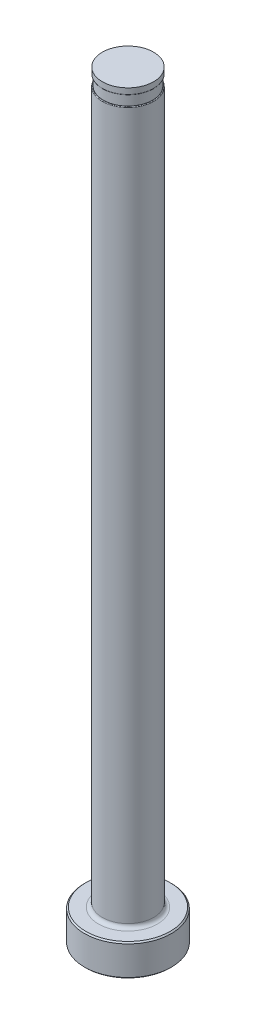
ISO-10303-21;
HEADER;
FILE_DESCRIPTION(('STEP AP214'),'2;1');
FILE_NAME('part.step','',(''),(''),'','','');
FILE_SCHEMA(('AUTOMOTIVE_DESIGN { 1 0 10303 214 1 1 1 1 }'));
ENDSEC;
DATA;
#1=APPLICATION_CONTEXT('core data for automotive mechanical design processes');
#2=APPLICATION_PROTOCOL_DEFINITION('international standard','automotive_design',2000,#1);
#3=PRODUCT_CONTEXT('',#1,'mechanical');
#4=PRODUCT('Part','Part','',(#3));
#5=PRODUCT_RELATED_PRODUCT_CATEGORY('part','',(#4));
#6=PRODUCT_DEFINITION_FORMATION('','',#4);
#7=PRODUCT_DEFINITION_CONTEXT('part definition',#1,'design');
#8=PRODUCT_DEFINITION('design','',#6,#7);
#9=PRODUCT_DEFINITION_SHAPE('','',#8);
#10=(LENGTH_UNIT() NAMED_UNIT(*) SI_UNIT(.MILLI.,.METRE.));
#11=(NAMED_UNIT(*) PLANE_ANGLE_UNIT() SI_UNIT($,.RADIAN.));
#12=(NAMED_UNIT(*) SI_UNIT($,.STERADIAN.) SOLID_ANGLE_UNIT());
#13=UNCERTAINTY_MEASURE_WITH_UNIT(LENGTH_MEASURE(1.E-05),#10,'distance_accuracy_value','');
#14=(GEOMETRIC_REPRESENTATION_CONTEXT(3) GLOBAL_UNCERTAINTY_ASSIGNED_CONTEXT((#13)) GLOBAL_UNIT_ASSIGNED_CONTEXT((#10,
#11,#12)) REPRESENTATION_CONTEXT('',''));
#15=CARTESIAN_POINT('',(0.,0.,0.));
#16=DIRECTION('',(0.,0.,1.));
#17=DIRECTION('',(1.,0.,0.));
#18=AXIS2_PLACEMENT_3D('',#15,#16,#17);
#19=CARTESIAN_POINT('',(-5.15873999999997,151.13,0.));
#20=DIRECTION('',(0.,1.,0.));
#21=DIRECTION('',(0.,0.,1.));
#22=AXIS2_PLACEMENT_3D('',#19,#20,#21);
#23=PLANE('',#22);
#24=CARTESIAN_POINT('',(0.,151.13,0.));
#25=DIRECTION('',(0.,1.,0.));
#26=DIRECTION('',(0.,0.,1.));
#27=AXIS2_PLACEMENT_3D('',#24,#25,#26);
#28=CIRCLE('',#27,5.01903999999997);
#29=CARTESIAN_POINT('',(0.,151.13,5.01903999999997));
#30=VERTEX_POINT('',#29);
#31=EDGE_CURVE('E11',#30,#30,#28,.F.);
#32=ORIENTED_EDGE('',*,*,#31,.T.);
#33=EDGE_LOOP('',(#32));
#34=FACE_BOUND('',#33,.T.);
#35=CARTESIAN_POINT('',(0.,151.13,0.));
#36=DIRECTION('',(0.,1.,0.));
#37=DIRECTION('',(0.,0.,1.));
#38=AXIS2_PLACEMENT_3D('',#35,#36,#37);
#39=CIRCLE('',#38,4.95553999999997);
#40=CARTESIAN_POINT('',(0.,151.13,4.95553999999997));
#41=VERTEX_POINT('',#40);
#42=EDGE_CURVE('E78',#41,#41,#39,.T.);
#43=ORIENTED_EDGE('',*,*,#42,.T.);
#44=EDGE_LOOP('',(#43));
#45=FACE_BOUND('',#44,.T.);
#46=ADVANCED_FACE('F36',(#34,#45),#23,.F.);
#47=CARTESIAN_POINT('',(0.,259.958771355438,0.));
#48=DIRECTION('',(0.,1.,0.));
#49=DIRECTION('',(0.,0.,1.));
#50=AXIS2_PLACEMENT_3D('',#47,#48,#49);
#51=CYLINDRICAL_SURFACE('',#50,5.15873999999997);
#52=DIRECTION('',(0.,1.,0.));
#53=VECTOR('',#52,1.);
#54=CARTESIAN_POINT('',(-4.95553999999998,259.958771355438,-1.43360444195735));
#55=LINE('',#54,#53);
#56=CARTESIAN_POINT('',(-4.95553999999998,148.971,-1.43360444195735));
#57=VERTEX_POINT('',#56);
#58=CARTESIAN_POINT('',(-4.95553999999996,86.614,-1.43360444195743));
#59=VERTEX_POINT('',#58);
#60=EDGE_CURVE('E73',#57,#59,#55,.F.);
#61=ORIENTED_EDGE('',*,*,#60,.F.);
#62=CARTESIAN_POINT('',(0.,148.971,0.));
#63=DIRECTION('',(0.,-1.,0.));
#64=DIRECTION('',(0.,0.,-1.));
#65=AXIS2_PLACEMENT_3D('',#62,#63,#64);
#66=CIRCLE('',#65,5.15873999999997);
#67=CARTESIAN_POINT('',(-4.95553999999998,148.971,1.43360444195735));
#68=VERTEX_POINT('',#67);
#69=EDGE_CURVE('E51',#57,#68,#66,.T.);
#70=ORIENTED_EDGE('',*,*,#69,.T.);
#71=DIRECTION('',(0.,1.,0.));
#72=VECTOR('',#71,1.);
#73=CARTESIAN_POINT('',(-4.95553999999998,259.958771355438,1.43360444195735));
#74=LINE('',#73,#72);
#75=CARTESIAN_POINT('',(-4.95553999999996,86.614,1.43360444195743));
#76=VERTEX_POINT('',#75);
#77=EDGE_CURVE('E84',#76,#68,#74,.T.);
#78=ORIENTED_EDGE('',*,*,#77,.F.);
#79=CARTESIAN_POINT('',(-4.95553999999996,86.614,-1.43360444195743));
#80=CARTESIAN_POINT('',(-4.95553725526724,86.5856189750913,-1.43360739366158));
#81=CARTESIAN_POINT('',(-4.95592104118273,86.5572557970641,-1.43228786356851));
#82=CARTESIAN_POINT('',(-4.95743326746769,86.5008072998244,-1.42704770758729));
#83=CARTESIAN_POINT('',(-4.9585612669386,86.4727218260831,-1.42312862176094));
#84=CARTESIAN_POINT('',(-4.9629961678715,86.3896356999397,-1.40761778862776));
#85=CARTESIAN_POINT('',(-4.96735491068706,86.3353485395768,-1.39227082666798));
#86=CARTESIAN_POINT('',(-4.97832723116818,86.2306470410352,-1.35250608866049));
#87=CARTESIAN_POINT('',(-4.98493672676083,86.18022589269,-1.32810472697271));
#88=CARTESIAN_POINT('',(-4.99967949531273,86.0841857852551,-1.27147840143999));
#89=CARTESIAN_POINT('',(-5.00781478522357,86.038573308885,-1.23924306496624));
#90=CARTESIAN_POINT('',(-5.02495905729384,85.9522108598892,-1.16779718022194));
#91=CARTESIAN_POINT('',(-5.03397951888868,85.9115461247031,-1.12848730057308));
#92=CARTESIAN_POINT('',(-5.05205730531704,85.8361357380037,-1.04458765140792));
#93=CARTESIAN_POINT('',(-5.0611146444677,85.8013926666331,-0.999995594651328));
#94=CARTESIAN_POINT('',(-5.0828087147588,85.722744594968,-0.884599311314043));
#95=CARTESIAN_POINT('',(-5.09511168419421,85.6822810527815,-0.811374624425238));
#96=CARTESIAN_POINT('',(-5.11705340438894,85.6135884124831,-0.659025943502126));
#97=CARTESIAN_POINT('',(-5.12668809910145,85.5853779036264,-0.579893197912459));
#98=CARTESIAN_POINT('',(-5.14250736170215,85.5402853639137,-0.417111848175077));
#99=CARTESIAN_POINT('',(-5.14864831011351,85.5235460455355,-0.333419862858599));
#100=CARTESIAN_POINT('',(-5.15681634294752,85.5014682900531,-0.164367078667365));
#101=CARTESIAN_POINT('',(-5.15884262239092,85.4961320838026,-0.0790059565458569));
#102=CARTESIAN_POINT('',(-5.15861184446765,85.4967349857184,0.105901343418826));
#103=CARTESIAN_POINT('',(-5.15558674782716,85.5046959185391,0.205446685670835));
#104=CARTESIAN_POINT('',(-5.14401053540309,85.5362458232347,0.401751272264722));
#105=CARTESIAN_POINT('',(-5.13546035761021,85.5598321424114,0.498510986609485));
#106=CARTESIAN_POINT('',(-5.11591338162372,85.6173193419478,0.667702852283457));
#107=CARTESIAN_POINT('',(-5.10571393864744,85.6483284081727,0.741210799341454));
#108=CARTESIAN_POINT('',(-5.08327564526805,85.7216570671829,0.882022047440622));
#109=CARTESIAN_POINT('',(-5.07103965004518,85.763960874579,0.949333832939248));
#110=CARTESIAN_POINT('',(-5.04847334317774,85.8504217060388,1.06213618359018));
#111=CARTESIAN_POINT('',(-5.03826194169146,85.892449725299,1.10927984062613));
#112=CARTESIAN_POINT('',(-5.01836605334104,85.9837827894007,1.19606762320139));
#113=CARTESIAN_POINT('',(-5.00868105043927,86.0330805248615,1.23571919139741));
#114=CARTESIAN_POINT('',(-4.99227488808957,86.1303011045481,1.30028176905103));
#115=CARTESIAN_POINT('',(-4.98532701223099,86.1773061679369,1.3265147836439));
#116=CARTESIAN_POINT('',(-4.97328889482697,86.2751640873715,1.37095861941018));
#117=CARTESIAN_POINT('',(-4.96819584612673,86.3260109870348,1.38918157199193));
#118=CARTESIAN_POINT('',(-4.96145831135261,86.4164594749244,1.41302693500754));
#119=CARTESIAN_POINT('',(-4.95925840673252,86.4554867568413,1.42070567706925));
#120=CARTESIAN_POINT('',(-4.95629015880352,86.5343307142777,1.43101136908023));
#121=CARTESIAN_POINT('',(-4.95552461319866,86.5741487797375,1.4336284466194));
#122=CARTESIAN_POINT('',(-4.95553999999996,86.614,1.43360444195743));
#123=B_SPLINE_CURVE_WITH_KNOTS('',3,(#79,#80,#81,#82,#83,#84,#85,#86,#87,#88,#89,#90,#91,#92,
#93,#94,#95,#96,#97,#98,#99,#100,#101,#102,#103,#104,#105,#106,#107,#108,#109,#110,#111,#112,
#113,#114,#115,#116,#117,#118,#119,#120,#121,#122),.UNSPECIFIED.,.F.,.F.,(4,2,2,2,2,2,2,2,2,2,2,
2,2,2,2,2,2,2,2,2,2,4),(0.,0.0850755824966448,0.170100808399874,0.338803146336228,
0.507201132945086,0.675823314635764,0.84702982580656,1.01831074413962,1.27062211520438,
1.52331494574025,1.77909706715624,2.03492922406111,2.33328986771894,2.63159987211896,
2.87199032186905,3.11204654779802,3.30325159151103,3.49426568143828,3.6564175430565,
3.81832296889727,3.93749321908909,4.05689566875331),.UNSPECIFIED.);
#124=EDGE_CURVE('E81',#59,#76,#123,.T.);
#125=ORIENTED_EDGE('',*,*,#124,.F.);
#126=EDGE_LOOP('',(#61,#70,#78,#125));
#127=FACE_BOUND('',#126,.T.);
#128=CARTESIAN_POINT('',(0.,7.11200000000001,0.));
#129=DIRECTION('',(0.,1.,0.));
#130=DIRECTION('',(0.,0.,1.));
#131=AXIS2_PLACEMENT_3D('',#128,#129,#130);
#132=CIRCLE('',#131,5.15873999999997);
#133=CARTESIAN_POINT('',(0.,7.11200000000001,5.15873999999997));
#134=VERTEX_POINT('',#133);
#135=EDGE_CURVE('E116',#134,#134,#132,.T.);
#136=ORIENTED_EDGE('',*,*,#135,.T.);
#137=EDGE_LOOP('',(#136));
#138=FACE_BOUND('',#137,.T.);
#139=ADVANCED_FACE('F82',(#127,#138),#51,.T.);
#140=CARTESIAN_POINT('',(0.,0.,0.));
#141=DIRECTION('',(0.,-1.,0.));
#142=DIRECTION('',(0.,0.,-1.));
#143=AXIS2_PLACEMENT_3D('',#140,#141,#142);
#144=PLANE('',#143);
#145=CARTESIAN_POINT('',(0.,0.,0.));
#146=DIRECTION('',(0.,-1.,0.));
#147=DIRECTION('',(0.,0.,-1.));
#148=AXIS2_PLACEMENT_3D('',#145,#146,#147);
#149=CIRCLE('',#148,8.47089999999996);
#150=CARTESIAN_POINT('',(0.,0.,-8.47089999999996));
#151=VERTEX_POINT('',#150);
#152=EDGE_CURVE('E113',#151,#151,#149,.T.);
#153=ORIENTED_EDGE('',*,*,#152,.T.);
#154=EDGE_LOOP('',(#153));
#155=FACE_BOUND('',#154,.T.);
#156=ADVANCED_FACE('F192',(#155),#144,.T.);
#157=CARTESIAN_POINT('',(0.,259.958771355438,0.));
#158=DIRECTION('',(0.,1.,0.));
#159=DIRECTION('',(0.,0.,1.));
#160=AXIS2_PLACEMENT_3D('',#157,#158,#159);
#161=CYLINDRICAL_SURFACE('',#160,8.72489999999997);
#162=CARTESIAN_POINT('',(0.,6.09600000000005,0.));
#163=DIRECTION('',(0.,1.,0.));
#164=DIRECTION('',(0.,0.,1.));
#165=AXIS2_PLACEMENT_3D('',#162,#163,#164);
#166=CIRCLE('',#165,8.72489999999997);
#167=CARTESIAN_POINT('',(0.,6.09600000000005,8.72489999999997));
#168=VERTEX_POINT('',#167);
#169=EDGE_CURVE('E110',#168,#168,#166,.F.);
#170=ORIENTED_EDGE('',*,*,#169,.T.);
#171=EDGE_LOOP('',(#170));
#172=FACE_BOUND('',#171,.T.);
#173=CARTESIAN_POINT('',(0.,0.254000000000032,0.));
#174=DIRECTION('',(0.,-1.,0.));
#175=DIRECTION('',(0.,0.,-1.));
#176=AXIS2_PLACEMENT_3D('',#173,#174,#175);
#177=CIRCLE('',#176,8.72489999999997);
#178=CARTESIAN_POINT('',(0.,0.254000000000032,-8.72489999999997));
#179=VERTEX_POINT('',#178);
#180=EDGE_CURVE('E107',#179,#179,#177,.F.);
#181=ORIENTED_EDGE('',*,*,#180,.T.);
#182=EDGE_LOOP('',(#181));
#183=FACE_BOUND('',#182,.T.);
#184=ADVANCED_FACE('F195',(#172,#183),#161,.T.);
#185=CARTESIAN_POINT('',(-8.72489999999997,6.35,0.));
#186=DIRECTION('',(0.,1.,0.));
#187=DIRECTION('',(0.,0.,1.));
#188=AXIS2_PLACEMENT_3D('',#185,#186,#187);
#189=PLANE('',#188);
#190=CARTESIAN_POINT('',(0.,6.35,0.));
#191=DIRECTION('',(0.,1.,0.));
#192=DIRECTION('',(0.,0.,1.));
#193=AXIS2_PLACEMENT_3D('',#190,#191,#192);
#194=CIRCLE('',#193,5.92073999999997);
#195=CARTESIAN_POINT('',(0.,6.35,5.92073999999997));
#196=VERTEX_POINT('',#195);
#197=EDGE_CURVE('E87',#196,#196,#194,.F.);
#198=ORIENTED_EDGE('',*,*,#197,.T.);
#199=EDGE_LOOP('',(#198));
#200=FACE_BOUND('',#199,.T.);
#201=CARTESIAN_POINT('',(0.,6.35,0.));
#202=DIRECTION('',(0.,1.,0.));
#203=DIRECTION('',(0.,0.,1.));
#204=AXIS2_PLACEMENT_3D('',#201,#202,#203);
#205=CIRCLE('',#204,8.47090000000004);
#206=CARTESIAN_POINT('',(0.,6.35,8.47090000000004));
#207=VERTEX_POINT('',#206);
#208=EDGE_CURVE('E104',#207,#207,#205,.T.);
#209=ORIENTED_EDGE('',*,*,#208,.T.);
#210=EDGE_LOOP('',(#209));
#211=FACE_BOUND('',#210,.T.);
#212=ADVANCED_FACE('F190',(#200,#211),#189,.T.);
#213=CARTESIAN_POINT('',(0.,6.35000000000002,0.));
#214=DIRECTION('',(0.,-1.,0.));
#215=DIRECTION('',(0.,0.,-1.));
#216=AXIS2_PLACEMENT_3D('',#213,#214,#215);
#217=CONICAL_SURFACE('',#216,8.47090000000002,0.785398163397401);
#218=ORIENTED_EDGE('',*,*,#169,.F.);
#219=EDGE_LOOP('',(#218));
#220=FACE_BOUND('',#219,.T.);
#221=ORIENTED_EDGE('',*,*,#208,.F.);
#222=EDGE_LOOP('',(#221));
#223=FACE_BOUND('',#222,.T.);
#224=ADVANCED_FACE('F186',(#220,#223),#217,.T.);
#225=CARTESIAN_POINT('',(0.,0.254000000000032,0.));
#226=DIRECTION('',(0.,1.,0.));
#227=DIRECTION('',(0.,0.,1.));
#228=AXIS2_PLACEMENT_3D('',#225,#226,#227);
#229=CONICAL_SURFACE('',#228,8.72489999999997,0.785398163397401);
#230=ORIENTED_EDGE('',*,*,#152,.F.);
#231=EDGE_LOOP('',(#230));
#232=FACE_BOUND('',#231,.T.);
#233=ORIENTED_EDGE('',*,*,#180,.F.);
#234=EDGE_LOOP('',(#233));
#235=FACE_BOUND('',#234,.T.);
#236=ADVANCED_FACE('F182',(#232,#235),#229,.T.);
#237=CARTESIAN_POINT('',(0.,7.11200000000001,0.));
#238=DIRECTION('',(0.,1.,0.));
#239=DIRECTION('',(0.,0.,1.));
#240=AXIS2_PLACEMENT_3D('',#237,#238,#239);
#241=TOROIDAL_SURFACE('',#240,5.92073999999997,0.762);
#242=ORIENTED_EDGE('',*,*,#197,.F.);
#243=EDGE_LOOP('',(#242));
#244=FACE_BOUND('',#243,.T.);
#245=ORIENTED_EDGE('',*,*,#135,.F.);
#246=EDGE_LOOP('',(#245));
#247=FACE_BOUND('',#246,.T.);
#248=ADVANCED_FACE('F147',(#244,#247),#241,.F.);
#249=CARTESIAN_POINT('',(-5.15873999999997,149.098,0.));
#250=DIRECTION('',(0.,-1.,0.));
#251=DIRECTION('',(0.,0.,-1.));
#252=AXIS2_PLACEMENT_3D('',#249,#250,#251);
#253=PLANE('',#252);
#254=DIRECTION('',(0.,0.,1.));
#255=VECTOR('',#254,1.);
#256=CARTESIAN_POINT('',(-4.95553999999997,149.098,0.));
#257=LINE('',#256,#255);
#258=CARTESIAN_POINT('',(-4.95553999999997,149.098,0.));
#259=VERTEX_POINT('',#258);
#260=CARTESIAN_POINT('',(-4.95553999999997,149.098,0.872370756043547));
#261=VERTEX_POINT('',#260);
#262=EDGE_CURVE('E90',#259,#261,#257,.T.);
#263=ORIENTED_EDGE('',*,*,#262,.T.);
#264=CARTESIAN_POINT('',(0.,149.098,0.));
#265=DIRECTION('',(0.,-1.,0.));
#266=DIRECTION('',(0.,0.,-1.));
#267=AXIS2_PLACEMENT_3D('',#264,#265,#266);
#268=CIRCLE('',#267,5.03173999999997);
#269=CARTESIAN_POINT('',(-4.95553999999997,149.098,-0.872370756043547));
#270=VERTEX_POINT('',#269);
#271=EDGE_CURVE('E86',#261,#270,#268,.F.);
#272=ORIENTED_EDGE('',*,*,#271,.T.);
#273=EDGE_CURVE('E79',#270,#259,#257,.T.);
#274=ORIENTED_EDGE('',*,*,#273,.T.);
#275=CARTESIAN_POINT('',(0.,149.098,0.));
#276=DIRECTION('',(0.,1.,0.));
#277=DIRECTION('',(0.,0.,1.));
#278=AXIS2_PLACEMENT_3D('',#275,#276,#277);
#279=CIRCLE('',#278,4.95553999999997);
#280=EDGE_CURVE('E101',#259,#259,#279,.T.);
#281=ORIENTED_EDGE('',*,*,#280,.F.);
#282=EDGE_LOOP('',(#263,#272,#274,#281));
#283=FACE_BOUND('',#282,.T.);
#284=ADVANCED_FACE('F144',(#283),#253,.F.);
#285=CARTESIAN_POINT('',(0.,153.448281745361,0.));
#286=DIRECTION('',(0.,1.,0.));
#287=DIRECTION('',(0.,0.,1.));
#288=AXIS2_PLACEMENT_3D('',#285,#286,#287);
#289=CYLINDRICAL_SURFACE('',#288,4.95553999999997);
#290=ORIENTED_EDGE('',*,*,#42,.F.);
#291=EDGE_LOOP('',(#290));
#292=FACE_BOUND('',#291,.T.);
#293=ORIENTED_EDGE('',*,*,#280,.T.);
#294=EDGE_LOOP('',(#293));
#295=FACE_BOUND('',#294,.T.);
#296=ADVANCED_FACE('F141',(#292,#295),#289,.T.);
#297=CARTESIAN_POINT('',(-4.95553999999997,150.114,-8.72489999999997));
#298=DIRECTION('',(1.,0.,0.));
#299=DIRECTION('',(0.,1.,0.));
#300=AXIS2_PLACEMENT_3D('',#297,#298,#299);
#301=PLANE('',#300);
#302=ORIENTED_EDGE('',*,*,#273,.F.);
#303=CARTESIAN_POINT('',(-4.95553999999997,149.098,-0.872370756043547));
#304=CARTESIAN_POINT('',(-4.95553999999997,149.097997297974,-0.893106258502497));
#305=CARTESIAN_POINT('',(-4.95553999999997,149.097847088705,-0.913843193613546));
#306=CARTESIAN_POINT('',(-4.95553999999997,149.097170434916,-0.955336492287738));
#307=CARTESIAN_POINT('',(-4.95553999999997,149.096643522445,-0.976092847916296));
#308=CARTESIAN_POINT('',(-4.95553999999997,149.095099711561,-1.01847199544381));
#309=CARTESIAN_POINT('',(-4.95553999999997,149.09406293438,-1.04009410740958));
#310=CARTESIAN_POINT('',(-4.95553999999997,149.091368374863,-1.08327970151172));
#311=CARTESIAN_POINT('',(-4.95553999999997,149.089711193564,-1.10484322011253));
#312=CARTESIAN_POINT('',(-4.95553999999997,149.085606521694,-1.14789214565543));
#313=CARTESIAN_POINT('',(-4.95553999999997,149.083159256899,-1.16937757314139));
#314=CARTESIAN_POINT('',(-4.95553999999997,149.077206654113,-1.21226394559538));
#315=CARTESIAN_POINT('',(-4.95553999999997,149.073698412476,-1.23366449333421));
#316=CARTESIAN_POINT('',(-4.95553999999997,149.065283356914,-1.27578226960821));
#317=CARTESIAN_POINT('',(-4.95553999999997,149.06040504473,-1.29650469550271));
#318=CARTESIAN_POINT('',(-4.95553999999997,149.051386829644,-1.32704228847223));
#319=CARTESIAN_POINT('',(-4.95553999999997,149.048106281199,-1.33710914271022));
#320=CARTESIAN_POINT('',(-4.95553999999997,149.04076790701,-1.35695139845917));
#321=CARTESIAN_POINT('',(-4.95553999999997,149.036711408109,-1.36672726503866));
#322=CARTESIAN_POINT('',(-4.95553999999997,149.029963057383,-1.38055335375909));
#323=CARTESIAN_POINT('',(-4.95553999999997,149.027728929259,-1.38482589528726));
#324=CARTESIAN_POINT('',(-4.95553999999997,149.022950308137,-1.39320953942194));
#325=CARTESIAN_POINT('',(-4.95553999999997,149.020405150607,-1.39732027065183));
#326=CARTESIAN_POINT('',(-4.95553999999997,149.014903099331,-1.40530983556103));
#327=CARTESIAN_POINT('',(-4.95553999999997,149.011943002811,-1.4091864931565));
#328=CARTESIAN_POINT('',(-4.95553999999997,149.005504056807,-1.4164922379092));
#329=CARTESIAN_POINT('',(-4.95553999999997,149.002026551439,-1.41992244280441));
#330=CARTESIAN_POINT('',(-4.95553999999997,148.996255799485,-1.4245087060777));
#331=CARTESIAN_POINT('',(-4.95553999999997,148.994201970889,-1.42596287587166));
#332=CARTESIAN_POINT('',(-4.95553999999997,148.989918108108,-1.42856560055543));
#333=CARTESIAN_POINT('',(-4.95553999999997,148.98768896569,-1.42971558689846));
#334=CARTESIAN_POINT('',(-4.95553999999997,148.983116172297,-1.4315912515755));
#335=CARTESIAN_POINT('',(-4.95553999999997,148.980776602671,-1.43232653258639));
#336=CARTESIAN_POINT('',(-4.95553999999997,148.975963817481,-1.43334161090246));
#337=CARTESIAN_POINT('',(-4.95553999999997,148.973489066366,-1.43361396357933));
#338=CARTESIAN_POINT('',(-4.95553999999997,148.971,-1.4336044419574));
#339=B_SPLINE_CURVE_WITH_KNOTS('',3,(#303,#304,#305,#306,#307,#308,#309,#310,#311,#312,#313,
#314,#315,#316,#317,#318,#319,#320,#321,#322,#323,#324,#325,#326,#327,#328,#329,#330,#331,#332,
#333,#334,#335,#336,#337,#338),.UNSPECIFIED.,.F.,.F.,(4,2,2,2,2,2,2,2,2,2,2,2,2,2,2,2,2,4),(0.,
0.062208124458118,0.124493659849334,0.189427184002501,0.254297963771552,0.319150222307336,
0.384181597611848,0.447949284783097,0.479695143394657,0.511387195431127,0.525842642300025,
0.54032953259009,0.554935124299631,0.569503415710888,0.577034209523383,0.584528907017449,
0.591842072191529,0.599271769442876),.UNSPECIFIED.);
#340=EDGE_CURVE('E59',#270,#57,#339,.T.);
#341=ORIENTED_EDGE('',*,*,#340,.T.);
#342=ORIENTED_EDGE('',*,*,#60,.T.);
#343=DIRECTION('',(0.,0.,1.));
#344=VECTOR('',#343,1.);
#345=CARTESIAN_POINT('',(-4.95553999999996,86.614,-8.72489999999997));
#346=LINE('',#345,#344);
#347=EDGE_CURVE('E77',#59,#76,#346,.T.);
#348=ORIENTED_EDGE('',*,*,#347,.T.);
#349=ORIENTED_EDGE('',*,*,#77,.T.);
#350=CARTESIAN_POINT('',(-4.95553999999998,148.971,1.43360444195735));
#351=CARTESIAN_POINT('',(-4.95553999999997,148.973376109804,1.43361259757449));
#352=CARTESIAN_POINT('',(-4.95553999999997,148.975740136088,1.4333648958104));
#353=CARTESIAN_POINT('',(-4.95553999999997,148.980346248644,1.43243706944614));
#354=CARTESIAN_POINT('',(-4.95553999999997,148.982589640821,1.43176356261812));
#355=CARTESIAN_POINT('',(-4.95553999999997,148.987448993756,1.4298565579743));
#356=CARTESIAN_POINT('',(-4.95553999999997,148.990026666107,1.42852797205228));
#357=CARTESIAN_POINT('',(-4.95553999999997,148.994948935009,1.42547523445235));
#358=CARTESIAN_POINT('',(-4.95553999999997,148.997291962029,1.42374864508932));
#359=CARTESIAN_POINT('',(-4.95553999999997,149.003411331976,1.4186377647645));
#360=CARTESIAN_POINT('',(-4.95553999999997,149.006953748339,1.41497736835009));
#361=CARTESIAN_POINT('',(-4.95553999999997,149.013498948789,1.40721445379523));
#362=CARTESIAN_POINT('',(-4.95553999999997,149.016500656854,1.40311107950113));
#363=CARTESIAN_POINT('',(-4.95553999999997,149.023478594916,1.39255193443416));
#364=CARTESIAN_POINT('',(-4.95553999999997,149.027205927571,1.38593356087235));
#365=CARTESIAN_POINT('',(-4.95553999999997,149.034038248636,1.37237820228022));
#366=CARTESIAN_POINT('',(-4.95553999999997,149.037141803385,1.36544052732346));
#367=CARTESIAN_POINT('',(-4.95553999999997,149.045787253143,1.34428318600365));
#368=CARTESIAN_POINT('',(-4.95553999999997,149.050628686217,1.32978099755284));
#369=CARTESIAN_POINT('',(-4.95553999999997,149.063034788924,1.28723764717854));
#370=CARTESIAN_POINT('',(-4.95553999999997,149.069113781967,1.25878972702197));
#371=CARTESIAN_POINT('',(-4.95553999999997,149.079029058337,1.20147182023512));
#372=CARTESIAN_POINT('',(-4.95553999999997,149.082859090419,1.17260088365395));
#373=CARTESIAN_POINT('',(-4.95553999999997,149.088985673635,1.1146900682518));
#374=CARTESIAN_POINT('',(-4.95553999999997,149.091281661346,1.08565013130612));
#375=CARTESIAN_POINT('',(-4.95553999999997,149.094773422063,1.02754153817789));
#376=CARTESIAN_POINT('',(-4.95553999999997,149.095970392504,0.998472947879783));
#377=CARTESIAN_POINT('',(-4.95553999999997,149.09719494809,0.953200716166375));
#378=CARTESIAN_POINT('',(-4.95553999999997,149.097505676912,0.937003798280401));
#379=CARTESIAN_POINT('',(-4.95553999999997,149.097907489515,0.90466142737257));
#380=CARTESIAN_POINT('',(-4.95553999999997,149.097999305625,0.888515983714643));
#381=CARTESIAN_POINT('',(-4.95553999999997,149.098,0.872370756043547));
#382=B_SPLINE_CURVE_WITH_KNOTS('',3,(#350,#351,#352,#353,#354,#355,#356,#357,#358,#359,#360,
#361,#362,#363,#364,#365,#366,#367,#368,#369,#370,#371,#372,#373,#374,#375,#376,#377,#378,#379,
#380,#381),.UNSPECIFIED.,.F.,.F.,(4,2,2,2,2,2,2,2,2,2,2,2,2,2,2,4),(0.,0.00709610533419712,
0.0140845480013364,0.0227350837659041,0.0314400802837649,0.0466358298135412,0.0618614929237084,
0.0845916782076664,0.107373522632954,0.153148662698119,0.240236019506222,0.327564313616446,
0.414924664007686,0.502189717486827,0.550788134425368,0.599223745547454),.UNSPECIFIED.);
#383=EDGE_CURVE('E172',#68,#261,#382,.T.);
#384=ORIENTED_EDGE('',*,*,#383,.T.);
#385=ORIENTED_EDGE('',*,*,#262,.F.);
#386=EDGE_LOOP('',(#302,#341,#342,#348,#349,#384,#385));
#387=FACE_BOUND('',#386,.T.);
#388=ADVANCED_FACE('F75',(#387),#301,.F.);
#389=CARTESIAN_POINT('',(-8.13053999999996,86.614,-8.72489999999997));
#390=DIRECTION('',(0.,0.,1.));
#391=DIRECTION('',(1.,0.,0.));
#392=AXIS2_PLACEMENT_3D('',#389,#390,#391);
#393=CYLINDRICAL_SURFACE('',#392,3.175);
#394=ORIENTED_EDGE('',*,*,#347,.F.);
#395=ORIENTED_EDGE('',*,*,#124,.T.);
#396=EDGE_LOOP('',(#394,#395));
#397=FACE_BOUND('',#396,.T.);
#398=ADVANCED_FACE('F89',(#397),#393,.F.);
#399=CARTESIAN_POINT('',(0.,152.687735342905,0.));
#400=DIRECTION('',(0.,1.,0.));
#401=DIRECTION('',(0.,0.,1.));
#402=AXIS2_PLACEMENT_3D('',#399,#400,#401);
#403=CYLINDRICAL_SURFACE('',#402,5.14603999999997);
#404=CARTESIAN_POINT('',(0.,151.257,0.));
#405=DIRECTION('',(0.,1.,0.));
#406=DIRECTION('',(0.,0.,1.));
#407=AXIS2_PLACEMENT_3D('',#404,#405,#406);
#408=CIRCLE('',#407,5.14603999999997);
#409=CARTESIAN_POINT('',(0.,151.257,5.14603999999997));
#410=VERTEX_POINT('',#409);
#411=EDGE_CURVE('E44',#410,#410,#408,.T.);
#412=ORIENTED_EDGE('',*,*,#411,.T.);
#413=EDGE_LOOP('',(#412));
#414=FACE_BOUND('',#413,.T.);
#415=CARTESIAN_POINT('',(0.,152.4,0.));
#416=DIRECTION('',(0.,1.,0.));
#417=DIRECTION('',(0.,0.,1.));
#418=AXIS2_PLACEMENT_3D('',#415,#416,#417);
#419=CIRCLE('',#418,5.14603999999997);
#420=CARTESIAN_POINT('',(0.,152.4,5.14603999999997));
#421=VERTEX_POINT('',#420);
#422=EDGE_CURVE('E91',#421,#421,#419,.T.);
#423=ORIENTED_EDGE('',*,*,#422,.F.);
#424=EDGE_LOOP('',(#423));
#425=FACE_BOUND('',#424,.T.);
#426=ADVANCED_FACE('F135',(#414,#425),#403,.T.);
#427=CARTESIAN_POINT('',(-5.15873999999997,152.4,0.));
#428=DIRECTION('',(0.,1.,0.));
#429=DIRECTION('',(0.,0.,1.));
#430=AXIS2_PLACEMENT_3D('',#427,#428,#429);
#431=PLANE('',#430);
#432=ORIENTED_EDGE('',*,*,#422,.T.);
#433=EDGE_LOOP('',(#432));
#434=FACE_BOUND('',#433,.T.);
#435=ADVANCED_FACE('F149',(#434),#431,.T.);
#436=CARTESIAN_POINT('',(0.,148.971,0.));
#437=DIRECTION('',(0.,-1.,0.));
#438=DIRECTION('',(0.,0.,-1.));
#439=AXIS2_PLACEMENT_3D('',#436,#437,#438);
#440=TOROIDAL_SURFACE('',#439,5.03173999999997,0.127);
#441=ORIENTED_EDGE('',*,*,#383,.F.);
#442=ORIENTED_EDGE('',*,*,#69,.F.);
#443=ORIENTED_EDGE('',*,*,#340,.F.);
#444=ORIENTED_EDGE('',*,*,#271,.F.);
#445=EDGE_LOOP('',(#441,#442,#443,#444));
#446=FACE_BOUND('',#445,.T.);
#447=ADVANCED_FACE('F151',(#446),#440,.T.);
#448=CARTESIAN_POINT('',(0.,151.257,0.));
#449=DIRECTION('',(0.,1.,0.));
#450=DIRECTION('',(0.,0.,1.));
#451=AXIS2_PLACEMENT_3D('',#448,#449,#450);
#452=TOROIDAL_SURFACE('',#451,5.01903999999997,0.127);
#453=ORIENTED_EDGE('',*,*,#31,.F.);
#454=EDGE_LOOP('',(#453));
#455=FACE_BOUND('',#454,.T.);
#456=ORIENTED_EDGE('',*,*,#411,.F.);
#457=EDGE_LOOP('',(#456));
#458=FACE_BOUND('',#457,.T.);
#459=ADVANCED_FACE('F38',(#455,#458),#452,.T.);
#460=CLOSED_SHELL('',(#46,#139,#156,#184,#212,#224,#236,#248,#284,#296,#388,#398,#426,#435,#447,#459));
#461=MANIFOLD_SOLID_BREP('B2',#460);
#462=ADVANCED_BREP_SHAPE_REPRESENTATION('',(#18,#461),#14);
#463=SHAPE_DEFINITION_REPRESENTATION(#9,#462);
ENDSEC;
END-ISO-10303-21;
